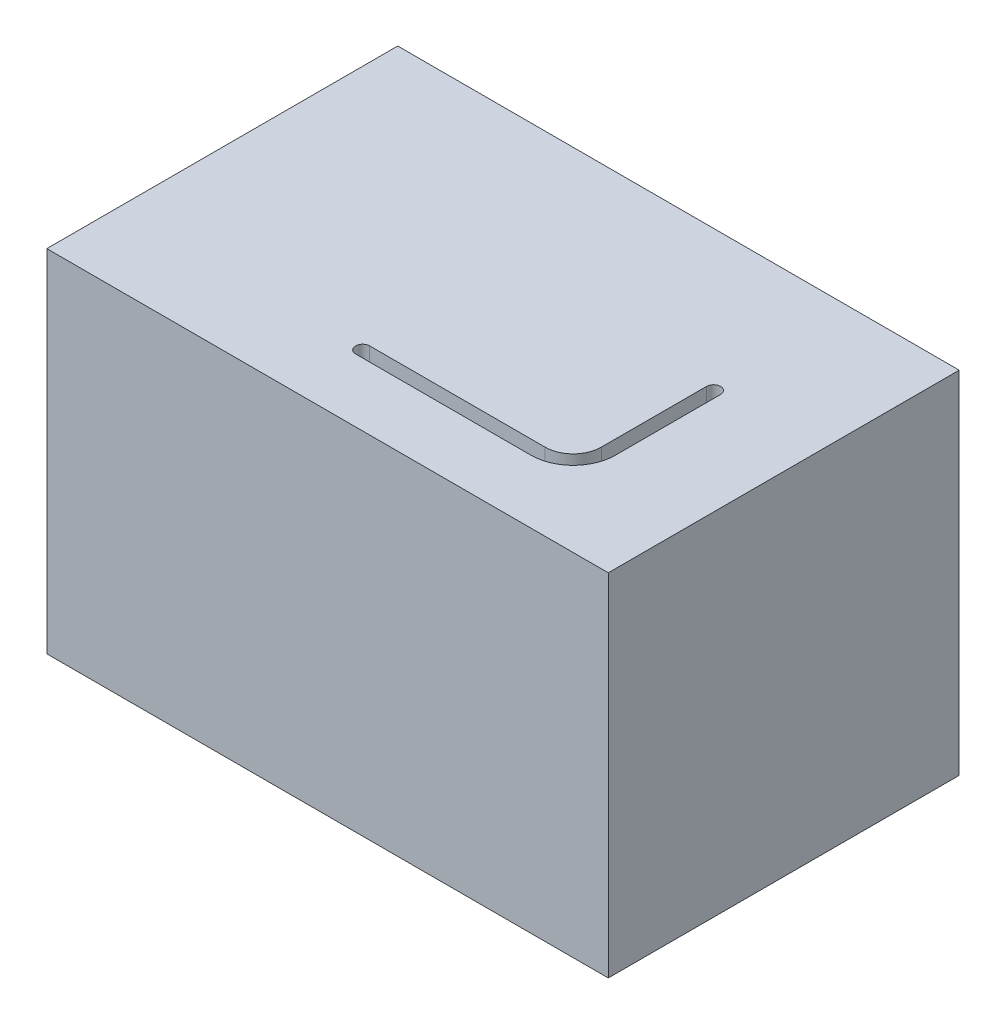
ISO-10303-21;
HEADER;
FILE_DESCRIPTION(('STEP AP214'),'2;1');
FILE_NAME('part.step','',(''),(''),'','','');
FILE_SCHEMA(('AUTOMOTIVE_DESIGN { 1 0 10303 214 1 1 1 1 }'));
ENDSEC;
DATA;
#1=APPLICATION_CONTEXT('core data for automotive mechanical design processes');
#2=APPLICATION_PROTOCOL_DEFINITION('international standard','automotive_design',2000,#1);
#3=PRODUCT_CONTEXT('',#1,'mechanical');
#4=PRODUCT('Part','Part','',(#3));
#5=PRODUCT_RELATED_PRODUCT_CATEGORY('part','',(#4));
#6=PRODUCT_DEFINITION_FORMATION('','',#4);
#7=PRODUCT_DEFINITION_CONTEXT('part definition',#1,'design');
#8=PRODUCT_DEFINITION('design','',#6,#7);
#9=PRODUCT_DEFINITION_SHAPE('','',#8);
#10=(LENGTH_UNIT() NAMED_UNIT(*) SI_UNIT(.MILLI.,.METRE.));
#11=(NAMED_UNIT(*) PLANE_ANGLE_UNIT() SI_UNIT($,.RADIAN.));
#12=(NAMED_UNIT(*) SI_UNIT($,.STERADIAN.) SOLID_ANGLE_UNIT());
#13=UNCERTAINTY_MEASURE_WITH_UNIT(LENGTH_MEASURE(1.E-05),#10,'distance_accuracy_value','');
#14=(GEOMETRIC_REPRESENTATION_CONTEXT(3) GLOBAL_UNCERTAINTY_ASSIGNED_CONTEXT((#13)) GLOBAL_UNIT_ASSIGNED_CONTEXT((#10,
#11,#12)) REPRESENTATION_CONTEXT('',''));
#15=CARTESIAN_POINT('',(0.,0.,0.));
#16=DIRECTION('',(0.,0.,1.));
#17=DIRECTION('',(1.,0.,0.));
#18=AXIS2_PLACEMENT_3D('',#15,#16,#17);
#19=CARTESIAN_POINT('',(-101.6,63.5,-63.5));
#20=DIRECTION('',(1.,0.,0.));
#21=DIRECTION('',(0.,0.,-1.));
#22=AXIS2_PLACEMENT_3D('',#19,#20,#21);
#23=PLANE('',#22);
#24=DIRECTION('',(0.,0.,1.));
#25=VECTOR('',#24,1.);
#26=CARTESIAN_POINT('',(-101.6,-63.5,-63.5));
#27=LINE('',#26,#25);
#28=CARTESIAN_POINT('',(-101.6,-63.5,-63.5));
#29=VERTEX_POINT('',#28);
#30=CARTESIAN_POINT('',(-101.6,-63.5,63.5));
#31=VERTEX_POINT('',#30);
#32=EDGE_CURVE('E178',#29,#31,#27,.T.);
#33=ORIENTED_EDGE('',*,*,#32,.T.);
#34=DIRECTION('',(0.,-1.,0.));
#35=VECTOR('',#34,1.);
#36=CARTESIAN_POINT('',(-101.6,63.5,63.5));
#37=LINE('',#36,#35);
#38=CARTESIAN_POINT('',(-101.6,63.5,63.5));
#39=VERTEX_POINT('',#38);
#40=EDGE_CURVE('E11',#39,#31,#37,.T.);
#41=ORIENTED_EDGE('',*,*,#40,.F.);
#42=DIRECTION('',(0.,0.,1.));
#43=VECTOR('',#42,1.);
#44=CARTESIAN_POINT('',(-101.6,63.5,-63.5));
#45=LINE('',#44,#43);
#46=CARTESIAN_POINT('',(-101.6,63.5,-63.5));
#47=VERTEX_POINT('',#46);
#48=EDGE_CURVE('E197',#47,#39,#45,.T.);
#49=ORIENTED_EDGE('',*,*,#48,.F.);
#50=DIRECTION('',(0.,-1.,0.));
#51=VECTOR('',#50,1.);
#52=CARTESIAN_POINT('',(-101.6,63.5,-63.5));
#53=LINE('',#52,#51);
#54=EDGE_CURVE('E206',#47,#29,#53,.T.);
#55=ORIENTED_EDGE('',*,*,#54,.T.);
#56=EDGE_LOOP('',(#33,#41,#49,#55));
#57=FACE_BOUND('',#56,.T.);
#58=ADVANCED_FACE('F31',(#57),#23,.F.);
#59=CARTESIAN_POINT('',(-101.6,63.5,63.5));
#60=DIRECTION('',(0.,0.,-1.));
#61=DIRECTION('',(-1.,0.,0.));
#62=AXIS2_PLACEMENT_3D('',#59,#60,#61);
#63=PLANE('',#62);
#64=DIRECTION('',(1.,0.,0.));
#65=VECTOR('',#64,1.);
#66=CARTESIAN_POINT('',(-101.6,-63.5,63.5));
#67=LINE('',#66,#65);
#68=CARTESIAN_POINT('',(101.6,-63.5,63.5));
#69=VERTEX_POINT('',#68);
#70=EDGE_CURVE('E191',#31,#69,#67,.T.);
#71=ORIENTED_EDGE('',*,*,#70,.T.);
#72=DIRECTION('',(0.,-1.,0.));
#73=VECTOR('',#72,1.);
#74=CARTESIAN_POINT('',(101.6,63.5,63.5));
#75=LINE('',#74,#73);
#76=CARTESIAN_POINT('',(101.6,63.5,63.5));
#77=VERTEX_POINT('',#76);
#78=EDGE_CURVE('E38',#77,#69,#75,.T.);
#79=ORIENTED_EDGE('',*,*,#78,.F.);
#80=DIRECTION('',(1.,0.,0.));
#81=VECTOR('',#80,1.);
#82=CARTESIAN_POINT('',(-101.6,63.5,63.5));
#83=LINE('',#82,#81);
#84=EDGE_CURVE('E200',#39,#77,#83,.T.);
#85=ORIENTED_EDGE('',*,*,#84,.F.);
#86=ORIENTED_EDGE('',*,*,#40,.T.);
#87=EDGE_LOOP('',(#71,#79,#85,#86));
#88=FACE_BOUND('',#87,.T.);
#89=ADVANCED_FACE('F230',(#88),#63,.F.);
#90=CARTESIAN_POINT('',(101.6,63.5,-63.5));
#91=DIRECTION('',(-1.,0.,0.));
#92=DIRECTION('',(0.,0.,1.));
#93=AXIS2_PLACEMENT_3D('',#90,#91,#92);
#94=PLANE('',#93);
#95=DIRECTION('',(0.,0.,-1.));
#96=VECTOR('',#95,1.);
#97=CARTESIAN_POINT('',(101.6,-63.5,-63.5));
#98=LINE('',#97,#96);
#99=CARTESIAN_POINT('',(101.6,-63.5,-63.5));
#100=VERTEX_POINT('',#99);
#101=EDGE_CURVE('E193',#69,#100,#98,.T.);
#102=ORIENTED_EDGE('',*,*,#101,.T.);
#103=DIRECTION('',(0.,-1.,0.));
#104=VECTOR('',#103,1.);
#105=CARTESIAN_POINT('',(101.6,63.5,-63.5));
#106=LINE('',#105,#104);
#107=CARTESIAN_POINT('',(101.6,63.5,-63.5));
#108=VERTEX_POINT('',#107);
#109=EDGE_CURVE('E209',#108,#100,#106,.T.);
#110=ORIENTED_EDGE('',*,*,#109,.F.);
#111=DIRECTION('',(0.,0.,-1.));
#112=VECTOR('',#111,1.);
#113=CARTESIAN_POINT('',(101.6,63.5,-63.5));
#114=LINE('',#113,#112);
#115=EDGE_CURVE('E202',#77,#108,#114,.T.);
#116=ORIENTED_EDGE('',*,*,#115,.F.);
#117=ORIENTED_EDGE('',*,*,#78,.T.);
#118=EDGE_LOOP('',(#102,#110,#116,#117));
#119=FACE_BOUND('',#118,.T.);
#120=ADVANCED_FACE('F216',(#119),#94,.F.);
#121=CARTESIAN_POINT('',(-101.6,63.5,-63.5));
#122=DIRECTION('',(0.,0.,1.));
#123=DIRECTION('',(1.,0.,0.));
#124=AXIS2_PLACEMENT_3D('',#121,#122,#123);
#125=PLANE('',#124);
#126=DIRECTION('',(-1.,0.,0.));
#127=VECTOR('',#126,1.);
#128=CARTESIAN_POINT('',(-101.6,-63.5,-63.5));
#129=LINE('',#128,#127);
#130=EDGE_CURVE('E195',#100,#29,#129,.T.);
#131=ORIENTED_EDGE('',*,*,#130,.T.);
#132=ORIENTED_EDGE('',*,*,#54,.F.);
#133=DIRECTION('',(-1.,0.,0.));
#134=VECTOR('',#133,1.);
#135=CARTESIAN_POINT('',(-101.6,63.5,-63.5));
#136=LINE('',#135,#134);
#137=EDGE_CURVE('E204',#108,#47,#136,.T.);
#138=ORIENTED_EDGE('',*,*,#137,.F.);
#139=ORIENTED_EDGE('',*,*,#109,.T.);
#140=EDGE_LOOP('',(#131,#132,#138,#139));
#141=FACE_BOUND('',#140,.T.);
#142=ADVANCED_FACE('F225',(#141),#125,.F.);
#143=CARTESIAN_POINT('',(-101.6,63.5,63.5));
#144=DIRECTION('',(0.,1.,0.));
#145=DIRECTION('',(0.,0.,1.));
#146=AXIS2_PLACEMENT_3D('',#143,#144,#145);
#147=PLANE('',#146);
#148=CARTESIAN_POINT('',(-12.7,63.5,38.1));
#149=DIRECTION('',(0.,1.,0.));
#150=DIRECTION('',(0.,0.,-1.));
#151=AXIS2_PLACEMENT_3D('',#148,#149,#150);
#152=CIRCLE('',#151,2.54);
#153=CARTESIAN_POINT('',(-12.7,63.5,35.56));
#154=VERTEX_POINT('',#153);
#155=CARTESIAN_POINT('',(-12.7,63.5,40.64));
#156=VERTEX_POINT('',#155);
#157=EDGE_CURVE('E45',#154,#156,#152,.T.);
#158=ORIENTED_EDGE('',*,*,#157,.F.);
#159=DIRECTION('',(-1.,0.,0.));
#160=VECTOR('',#159,1.);
#161=CARTESIAN_POINT('',(-12.7,63.5,35.56));
#162=LINE('',#161,#160);
#163=CARTESIAN_POINT('',(50.8,63.5,35.56));
#164=VERTEX_POINT('',#163);
#165=EDGE_CURVE('E152',#164,#154,#162,.T.);
#166=ORIENTED_EDGE('',*,*,#165,.F.);
#167=CARTESIAN_POINT('',(50.8,63.5,25.4));
#168=DIRECTION('',(0.,-1.,0.));
#169=DIRECTION('',(0.,0.,1.));
#170=AXIS2_PLACEMENT_3D('',#167,#168,#169);
#171=CIRCLE('',#170,10.16);
#172=CARTESIAN_POINT('',(60.96,63.5,25.4));
#173=VERTEX_POINT('',#172);
#174=EDGE_CURVE('E149',#173,#164,#171,.T.);
#175=ORIENTED_EDGE('',*,*,#174,.F.);
#176=DIRECTION('',(0.,0.,1.));
#177=VECTOR('',#176,1.);
#178=CARTESIAN_POINT('',(60.96,63.5,25.4));
#179=LINE('',#178,#177);
#180=CARTESIAN_POINT('',(60.96,63.5,-12.7));
#181=VERTEX_POINT('',#180);
#182=EDGE_CURVE('E146',#181,#173,#179,.T.);
#183=ORIENTED_EDGE('',*,*,#182,.F.);
#184=CARTESIAN_POINT('',(63.5,63.5,-12.7));
#185=DIRECTION('',(0.,1.,0.));
#186=DIRECTION('',(0.,0.,1.));
#187=AXIS2_PLACEMENT_3D('',#184,#185,#186);
#188=CIRCLE('',#187,2.54);
#189=CARTESIAN_POINT('',(66.04,63.5,-12.7));
#190=VERTEX_POINT('',#189);
#191=EDGE_CURVE('E140',#190,#181,#188,.T.);
#192=ORIENTED_EDGE('',*,*,#191,.F.);
#193=DIRECTION('',(0.,0.,-1.));
#194=VECTOR('',#193,1.);
#195=CARTESIAN_POINT('',(66.04,63.5,25.4));
#196=LINE('',#195,#194);
#197=CARTESIAN_POINT('',(66.04,63.5,25.4));
#198=VERTEX_POINT('',#197);
#199=EDGE_CURVE('E138',#198,#190,#196,.T.);
#200=ORIENTED_EDGE('',*,*,#199,.F.);
#201=CARTESIAN_POINT('',(50.8,63.5,25.4));
#202=DIRECTION('',(0.,1.,0.));
#203=DIRECTION('',(0.,0.,1.));
#204=AXIS2_PLACEMENT_3D('',#201,#202,#203);
#205=CIRCLE('',#204,15.24);
#206=CARTESIAN_POINT('',(50.8,63.5,40.64));
#207=VERTEX_POINT('',#206);
#208=EDGE_CURVE('E121',#207,#198,#205,.T.);
#209=ORIENTED_EDGE('',*,*,#208,.F.);
#210=DIRECTION('',(1.,0.,0.));
#211=VECTOR('',#210,1.);
#212=CARTESIAN_POINT('',(-12.7,63.5,40.64));
#213=LINE('',#212,#211);
#214=EDGE_CURVE('E130',#156,#207,#213,.T.);
#215=ORIENTED_EDGE('',*,*,#214,.F.);
#216=EDGE_LOOP('',(#158,#166,#175,#183,#192,#200,#209,#215));
#217=FACE_BOUND('',#216,.T.);
#218=ORIENTED_EDGE('',*,*,#48,.T.);
#219=ORIENTED_EDGE('',*,*,#84,.T.);
#220=ORIENTED_EDGE('',*,*,#115,.T.);
#221=ORIENTED_EDGE('',*,*,#137,.T.);
#222=EDGE_LOOP('',(#218,#219,#220,#221));
#223=FACE_BOUND('',#222,.T.);
#224=ADVANCED_FACE('F134',(#217,#223),#147,.T.);
#225=CARTESIAN_POINT('',(-101.6,-63.5,63.5));
#226=DIRECTION('',(0.,1.,0.));
#227=DIRECTION('',(0.,0.,1.));
#228=AXIS2_PLACEMENT_3D('',#225,#226,#227);
#229=PLANE('',#228);
#230=DIRECTION('',(-1.,0.,0.));
#231=VECTOR('',#230,1.);
#232=CARTESIAN_POINT('',(-12.7,-63.5,35.56));
#233=LINE('',#232,#231);
#234=CARTESIAN_POINT('',(50.8,-63.5,35.56));
#235=VERTEX_POINT('',#234);
#236=CARTESIAN_POINT('',(-12.7,-63.5,35.56));
#237=VERTEX_POINT('',#236);
#238=EDGE_CURVE('E173',#235,#237,#233,.T.);
#239=ORIENTED_EDGE('',*,*,#238,.T.);
#240=CARTESIAN_POINT('',(-12.7,-63.5,38.1));
#241=DIRECTION('',(0.,1.,0.));
#242=DIRECTION('',(0.,0.,-1.));
#243=AXIS2_PLACEMENT_3D('',#240,#241,#242);
#244=CIRCLE('',#243,2.54);
#245=CARTESIAN_POINT('',(-12.7,-63.5,40.64));
#246=VERTEX_POINT('',#245);
#247=EDGE_CURVE('E155',#237,#246,#244,.T.);
#248=ORIENTED_EDGE('',*,*,#247,.T.);
#249=DIRECTION('',(1.,0.,0.));
#250=VECTOR('',#249,1.);
#251=CARTESIAN_POINT('',(-12.7,-63.5,40.64));
#252=LINE('',#251,#250);
#253=CARTESIAN_POINT('',(50.8,-63.5,40.64));
#254=VERTEX_POINT('',#253);
#255=EDGE_CURVE('E158',#246,#254,#252,.T.);
#256=ORIENTED_EDGE('',*,*,#255,.T.);
#257=CARTESIAN_POINT('',(50.8,-63.5,25.4));
#258=DIRECTION('',(0.,1.,0.));
#259=DIRECTION('',(0.,0.,1.));
#260=AXIS2_PLACEMENT_3D('',#257,#258,#259);
#261=CIRCLE('',#260,15.24);
#262=CARTESIAN_POINT('',(66.04,-63.5,25.4));
#263=VERTEX_POINT('',#262);
#264=EDGE_CURVE('E53',#254,#263,#261,.T.);
#265=ORIENTED_EDGE('',*,*,#264,.T.);
#266=DIRECTION('',(0.,0.,-1.));
#267=VECTOR('',#266,1.);
#268=CARTESIAN_POINT('',(66.04,-63.5,25.4));
#269=LINE('',#268,#267);
#270=CARTESIAN_POINT('',(66.04,-63.5,-12.7));
#271=VERTEX_POINT('',#270);
#272=EDGE_CURVE('E161',#263,#271,#269,.T.);
#273=ORIENTED_EDGE('',*,*,#272,.T.);
#274=CARTESIAN_POINT('',(63.5,-63.5,-12.7));
#275=DIRECTION('',(0.,1.,0.));
#276=DIRECTION('',(0.,0.,1.));
#277=AXIS2_PLACEMENT_3D('',#274,#275,#276);
#278=CIRCLE('',#277,2.54);
#279=CARTESIAN_POINT('',(60.96,-63.5,-12.7));
#280=VERTEX_POINT('',#279);
#281=EDGE_CURVE('E164',#271,#280,#278,.T.);
#282=ORIENTED_EDGE('',*,*,#281,.T.);
#283=DIRECTION('',(0.,0.,1.));
#284=VECTOR('',#283,1.);
#285=CARTESIAN_POINT('',(60.96,-63.5,25.4));
#286=LINE('',#285,#284);
#287=CARTESIAN_POINT('',(60.96,-63.5,25.4));
#288=VERTEX_POINT('',#287);
#289=EDGE_CURVE('E167',#280,#288,#286,.T.);
#290=ORIENTED_EDGE('',*,*,#289,.T.);
#291=CARTESIAN_POINT('',(50.8,-63.5,25.4));
#292=DIRECTION('',(0.,-1.,0.));
#293=DIRECTION('',(0.,0.,1.));
#294=AXIS2_PLACEMENT_3D('',#291,#292,#293);
#295=CIRCLE('',#294,10.16);
#296=EDGE_CURVE('E170',#288,#235,#295,.T.);
#297=ORIENTED_EDGE('',*,*,#296,.T.);
#298=EDGE_LOOP('',(#239,#248,#256,#265,#273,#282,#290,#297));
#299=FACE_BOUND('',#298,.T.);
#300=ORIENTED_EDGE('',*,*,#32,.F.);
#301=ORIENTED_EDGE('',*,*,#130,.F.);
#302=ORIENTED_EDGE('',*,*,#101,.F.);
#303=ORIENTED_EDGE('',*,*,#70,.F.);
#304=EDGE_LOOP('',(#300,#301,#302,#303));
#305=FACE_BOUND('',#304,.T.);
#306=ADVANCED_FACE('F222',(#299,#305),#229,.F.);
#307=CARTESIAN_POINT('',(-12.7,-63.5,38.1));
#308=DIRECTION('',(0.,1.,0.));
#309=DIRECTION('',(0.,0.,1.));
#310=AXIS2_PLACEMENT_3D('',#307,#308,#309);
#311=CYLINDRICAL_SURFACE('',#310,2.54);
#312=ORIENTED_EDGE('',*,*,#157,.T.);
#313=DIRECTION('',(0.,1.,0.));
#314=VECTOR('',#313,1.);
#315=CARTESIAN_POINT('',(-12.7,-63.5,40.64));
#316=LINE('',#315,#314);
#317=EDGE_CURVE('E127',#246,#156,#316,.T.);
#318=ORIENTED_EDGE('',*,*,#317,.F.);
#319=ORIENTED_EDGE('',*,*,#247,.F.);
#320=DIRECTION('',(0.,1.,0.));
#321=VECTOR('',#320,1.);
#322=CARTESIAN_POINT('',(-12.7,-63.5,35.56));
#323=LINE('',#322,#321);
#324=EDGE_CURVE('E176',#237,#154,#323,.T.);
#325=ORIENTED_EDGE('',*,*,#324,.T.);
#326=EDGE_LOOP('',(#312,#318,#319,#325));
#327=FACE_BOUND('',#326,.T.);
#328=ADVANCED_FACE('F244',(#327),#311,.F.);
#329=CARTESIAN_POINT('',(-12.7,-63.5,35.56));
#330=DIRECTION('',(0.,0.,-1.));
#331=DIRECTION('',(-1.,0.,0.));
#332=AXIS2_PLACEMENT_3D('',#329,#330,#331);
#333=PLANE('',#332);
#334=ORIENTED_EDGE('',*,*,#165,.T.);
#335=ORIENTED_EDGE('',*,*,#324,.F.);
#336=ORIENTED_EDGE('',*,*,#238,.F.);
#337=DIRECTION('',(0.,1.,0.));
#338=VECTOR('',#337,1.);
#339=CARTESIAN_POINT('',(50.8,-63.5,35.56));
#340=LINE('',#339,#338);
#341=EDGE_CURVE('E179',#235,#164,#340,.T.);
#342=ORIENTED_EDGE('',*,*,#341,.T.);
#343=EDGE_LOOP('',(#334,#335,#336,#342));
#344=FACE_BOUND('',#343,.T.);
#345=ADVANCED_FACE('F248',(#344),#333,.F.);
#346=CARTESIAN_POINT('',(50.8,-63.5,25.4));
#347=DIRECTION('',(0.,1.,0.));
#348=DIRECTION('',(0.,0.,1.));
#349=AXIS2_PLACEMENT_3D('',#346,#347,#348);
#350=CYLINDRICAL_SURFACE('',#349,10.16);
#351=ORIENTED_EDGE('',*,*,#174,.T.);
#352=ORIENTED_EDGE('',*,*,#341,.F.);
#353=ORIENTED_EDGE('',*,*,#296,.F.);
#354=DIRECTION('',(0.,1.,0.));
#355=VECTOR('',#354,1.);
#356=CARTESIAN_POINT('',(60.96,-63.5,25.4));
#357=LINE('',#356,#355);
#358=EDGE_CURVE('E181',#288,#173,#357,.T.);
#359=ORIENTED_EDGE('',*,*,#358,.T.);
#360=EDGE_LOOP('',(#351,#352,#353,#359));
#361=FACE_BOUND('',#360,.T.);
#362=ADVANCED_FACE('F264',(#361),#350,.T.);
#363=CARTESIAN_POINT('',(60.96,-63.5,25.4));
#364=DIRECTION('',(-1.,0.,0.));
#365=DIRECTION('',(0.,0.,1.));
#366=AXIS2_PLACEMENT_3D('',#363,#364,#365);
#367=PLANE('',#366);
#368=ORIENTED_EDGE('',*,*,#182,.T.);
#369=ORIENTED_EDGE('',*,*,#358,.F.);
#370=ORIENTED_EDGE('',*,*,#289,.F.);
#371=DIRECTION('',(0.,1.,0.));
#372=VECTOR('',#371,1.);
#373=CARTESIAN_POINT('',(60.96,-63.5,-12.7));
#374=LINE('',#373,#372);
#375=EDGE_CURVE('E183',#280,#181,#374,.T.);
#376=ORIENTED_EDGE('',*,*,#375,.T.);
#377=EDGE_LOOP('',(#368,#369,#370,#376));
#378=FACE_BOUND('',#377,.T.);
#379=ADVANCED_FACE('F260',(#378),#367,.F.);
#380=CARTESIAN_POINT('',(63.5,-63.5,-12.7));
#381=DIRECTION('',(0.,1.,0.));
#382=DIRECTION('',(0.,0.,1.));
#383=AXIS2_PLACEMENT_3D('',#380,#381,#382);
#384=CYLINDRICAL_SURFACE('',#383,2.54);
#385=ORIENTED_EDGE('',*,*,#191,.T.);
#386=ORIENTED_EDGE('',*,*,#375,.F.);
#387=ORIENTED_EDGE('',*,*,#281,.F.);
#388=DIRECTION('',(0.,1.,0.));
#389=VECTOR('',#388,1.);
#390=CARTESIAN_POINT('',(66.04,-63.5,-12.7));
#391=LINE('',#390,#389);
#392=EDGE_CURVE('E185',#271,#190,#391,.T.);
#393=ORIENTED_EDGE('',*,*,#392,.T.);
#394=EDGE_LOOP('',(#385,#386,#387,#393));
#395=FACE_BOUND('',#394,.T.);
#396=ADVANCED_FACE('F256',(#395),#384,.F.);
#397=CARTESIAN_POINT('',(66.04,-63.5,25.4));
#398=DIRECTION('',(1.,0.,0.));
#399=DIRECTION('',(0.,0.,-1.));
#400=AXIS2_PLACEMENT_3D('',#397,#398,#399);
#401=PLANE('',#400);
#402=ORIENTED_EDGE('',*,*,#199,.T.);
#403=ORIENTED_EDGE('',*,*,#392,.F.);
#404=ORIENTED_EDGE('',*,*,#272,.F.);
#405=DIRECTION('',(0.,1.,0.));
#406=VECTOR('',#405,1.);
#407=CARTESIAN_POINT('',(66.04,-63.5,25.4));
#408=LINE('',#407,#406);
#409=EDGE_CURVE('E126',#263,#198,#408,.T.);
#410=ORIENTED_EDGE('',*,*,#409,.T.);
#411=EDGE_LOOP('',(#402,#403,#404,#410));
#412=FACE_BOUND('',#411,.T.);
#413=ADVANCED_FACE('F253',(#412),#401,.F.);
#414=CARTESIAN_POINT('',(50.8,-63.5,25.4));
#415=DIRECTION('',(0.,1.,0.));
#416=DIRECTION('',(0.,0.,1.));
#417=AXIS2_PLACEMENT_3D('',#414,#415,#416);
#418=CYLINDRICAL_SURFACE('',#417,15.24);
#419=ORIENTED_EDGE('',*,*,#208,.T.);
#420=ORIENTED_EDGE('',*,*,#409,.F.);
#421=ORIENTED_EDGE('',*,*,#264,.F.);
#422=DIRECTION('',(0.,1.,0.));
#423=VECTOR('',#422,1.);
#424=CARTESIAN_POINT('',(50.8,-63.5,40.64));
#425=LINE('',#424,#423);
#426=EDGE_CURVE('E117',#254,#207,#425,.T.);
#427=ORIENTED_EDGE('',*,*,#426,.T.);
#428=EDGE_LOOP('',(#419,#420,#421,#427));
#429=FACE_BOUND('',#428,.T.);
#430=ADVANCED_FACE('F119',(#429),#418,.F.);
#431=CARTESIAN_POINT('',(-12.7,-63.5,40.64));
#432=DIRECTION('',(0.,0.,1.));
#433=DIRECTION('',(1.,0.,0.));
#434=AXIS2_PLACEMENT_3D('',#431,#432,#433);
#435=PLANE('',#434);
#436=ORIENTED_EDGE('',*,*,#214,.T.);
#437=ORIENTED_EDGE('',*,*,#426,.F.);
#438=ORIENTED_EDGE('',*,*,#255,.F.);
#439=ORIENTED_EDGE('',*,*,#317,.T.);
#440=EDGE_LOOP('',(#436,#437,#438,#439));
#441=FACE_BOUND('',#440,.T.);
#442=ADVANCED_FACE('F131',(#441),#435,.F.);
#443=CLOSED_SHELL('',(#58,#89,#120,#142,#224,#306,#328,#345,#362,#379,#396,#413,#430,#442));
#444=MANIFOLD_SOLID_BREP('B2',#443);
#445=ADVANCED_BREP_SHAPE_REPRESENTATION('',(#18,#444),#14);
#446=SHAPE_DEFINITION_REPRESENTATION(#9,#445);
ENDSEC;
END-ISO-10303-21;
